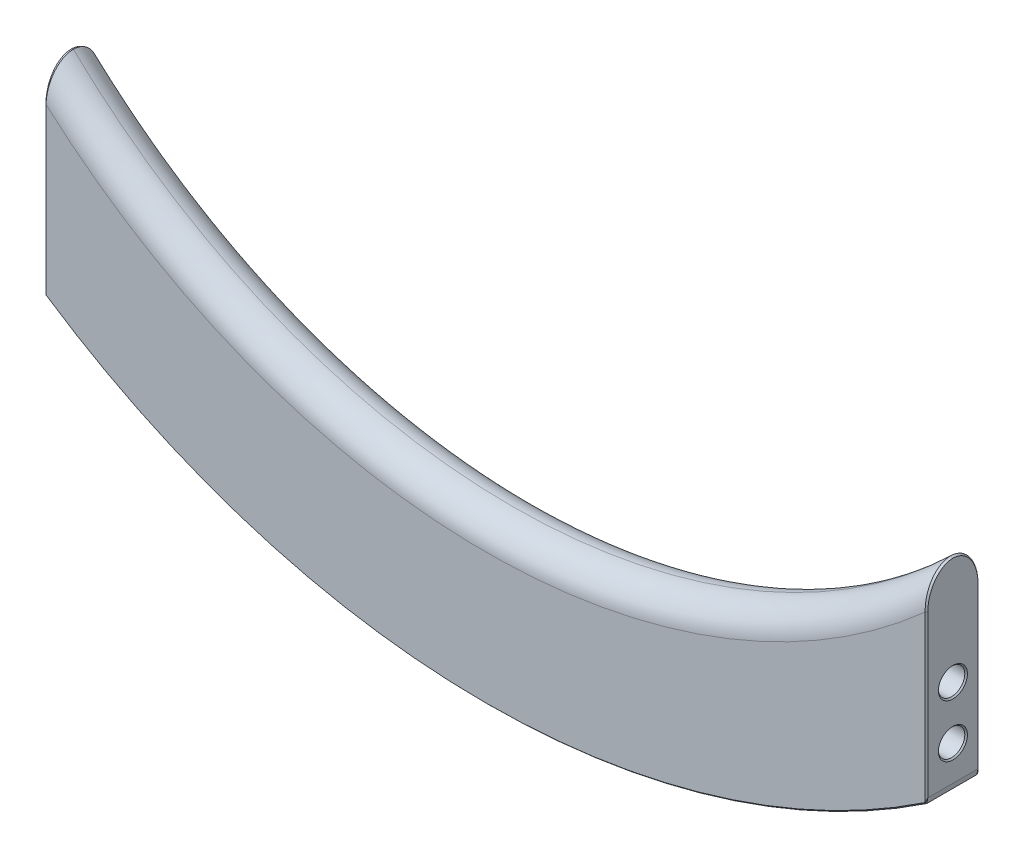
ISO-10303-21;
HEADER;
FILE_DESCRIPTION(('STEP AP214'),'2;1');
FILE_NAME('part.step','',(''),(''),'','','');
FILE_SCHEMA(('AUTOMOTIVE_DESIGN { 1 0 10303 214 1 1 1 1 }'));
ENDSEC;
DATA;
#1=APPLICATION_CONTEXT('core data for automotive mechanical design processes');
#2=APPLICATION_PROTOCOL_DEFINITION('international standard','automotive_design',2000,#1);
#3=PRODUCT_CONTEXT('',#1,'mechanical');
#4=PRODUCT('Part','Part','',(#3));
#5=PRODUCT_RELATED_PRODUCT_CATEGORY('part','',(#4));
#6=PRODUCT_DEFINITION_FORMATION('','',#4);
#7=PRODUCT_DEFINITION_CONTEXT('part definition',#1,'design');
#8=PRODUCT_DEFINITION('design','',#6,#7);
#9=PRODUCT_DEFINITION_SHAPE('','',#8);
#10=(LENGTH_UNIT() NAMED_UNIT(*) SI_UNIT(.MILLI.,.METRE.));
#11=(NAMED_UNIT(*) PLANE_ANGLE_UNIT() SI_UNIT($,.RADIAN.));
#12=(NAMED_UNIT(*) SI_UNIT($,.STERADIAN.) SOLID_ANGLE_UNIT());
#13=UNCERTAINTY_MEASURE_WITH_UNIT(LENGTH_MEASURE(1.E-05),#10,'distance_accuracy_value','');
#14=(GEOMETRIC_REPRESENTATION_CONTEXT(3) GLOBAL_UNCERTAINTY_ASSIGNED_CONTEXT((#13)) GLOBAL_UNIT_ASSIGNED_CONTEXT((#10,
#11,#12)) REPRESENTATION_CONTEXT('',''));
#15=CARTESIAN_POINT('',(0.,0.,0.));
#16=DIRECTION('',(0.,0.,1.));
#17=DIRECTION('',(1.,0.,0.));
#18=AXIS2_PLACEMENT_3D('',#15,#16,#17);
#19=CARTESIAN_POINT('',(-167.,-172.368790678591,10.));
#20=DIRECTION('',(1.,0.,0.));
#21=DIRECTION('',(0.,1.,0.));
#22=AXIS2_PLACEMENT_3D('',#19,#20,#21);
#23=PLANE('',#22);
#24=CARTESIAN_POINT('',(-167.,-234.220785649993,0.));
#25=DIRECTION('',(1.,0.,0.));
#26=DIRECTION('',(0.,1.,0.));
#27=AXIS2_PLACEMENT_3D('',#24,#25,#26);
#28=CIRCLE('',#27,5.50000000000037);
#29=CARTESIAN_POINT('',(-167.,-228.720785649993,0.));
#30=VERTEX_POINT('',#29);
#31=EDGE_CURVE('E160',#30,#30,#28,.T.);
#32=ORIENTED_EDGE('',*,*,#31,.T.);
#33=EDGE_LOOP('',(#32));
#34=FACE_BOUND('',#33,.T.);
#35=CARTESIAN_POINT('',(-167.,-214.220785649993,0.));
#36=DIRECTION('',(1.,0.,0.));
#37=DIRECTION('',(0.,1.,0.));
#38=AXIS2_PLACEMENT_3D('',#35,#36,#37);
#39=CIRCLE('',#38,5.50000000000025);
#40=CARTESIAN_POINT('',(-167.,-208.720785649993,0.));
#41=VERTEX_POINT('',#40);
#42=EDGE_CURVE('E157',#41,#41,#39,.T.);
#43=ORIENTED_EDGE('',*,*,#42,.T.);
#44=EDGE_LOOP('',(#43));
#45=FACE_BOUND('',#44,.T.);
#46=DIRECTION('',(0.,-1.,0.));
#47=VECTOR('',#46,1.);
#48=CARTESIAN_POINT('',(-167.,-172.368790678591,-9.5));
#49=LINE('',#48,#47);
#50=CARTESIAN_POINT('',(-167.,-186.487935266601,-9.5));
#51=VERTEX_POINT('',#50);
#52=CARTESIAN_POINT('',(-167.,-248.720785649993,-9.5));
#53=VERTEX_POINT('',#52);
#54=EDGE_CURVE('E156',#51,#53,#49,.T.);
#55=ORIENTED_EDGE('',*,*,#54,.T.);
#56=DIRECTION('',(0.,0.,1.));
#57=VECTOR('',#56,1.);
#58=CARTESIAN_POINT('',(-167.,-248.720785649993,10.));
#59=LINE('',#58,#57);
#60=CARTESIAN_POINT('',(-167.,-248.720785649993,9.5));
#61=VERTEX_POINT('',#60);
#62=EDGE_CURVE('E139',#53,#61,#59,.T.);
#63=ORIENTED_EDGE('',*,*,#62,.T.);
#64=DIRECTION('',(0.,1.,0.));
#65=VECTOR('',#64,1.);
#66=CARTESIAN_POINT('',(-167.,-186.040318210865,9.5));
#67=LINE('',#66,#65);
#68=CARTESIAN_POINT('',(-167.,-186.487935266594,9.5));
#69=VERTEX_POINT('',#68);
#70=EDGE_CURVE('E145',#61,#69,#67,.T.);
#71=ORIENTED_EDGE('',*,*,#70,.T.);
#72=CARTESIAN_POINT('',(-167.,-173.545383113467,0.));
#73=CARTESIAN_POINT('',(-167.,-173.538921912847,1.48173565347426));
#74=CARTESIAN_POINT('',(-167.,-174.041638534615,2.93362200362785));
#75=CARTESIAN_POINT('',(-167.,-175.707416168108,5.3930119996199));
#76=CARTESIAN_POINT('',(-167.,-176.817437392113,6.39422092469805));
#77=CARTESIAN_POINT('',(-167.,-179.326803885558,7.97856826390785));
#78=CARTESIAN_POINT('',(-167.,-180.677158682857,8.54210713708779));
#79=CARTESIAN_POINT('',(-167.,-183.540260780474,9.31186177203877));
#80=CARTESIAN_POINT('',(-167.,-185.005194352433,9.49883322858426));
#81=CARTESIAN_POINT('',(-167.,-186.487935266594,9.5));
#82=B_SPLINE_CURVE_WITH_KNOTS('',3,(#72,#73,#74,#75,#76,#77,#78,#79,#80,#81),.UNSPECIFIED.,.F.,
.F.,(4,2,2,2,4),(0.,0.00440937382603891,0.00881874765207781,0.0132281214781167,
0.0176374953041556),.UNSPECIFIED.);
#83=CARTESIAN_POINT('',(-167.,-173.545383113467,0.));
#84=VERTEX_POINT('',#83);
#85=EDGE_CURVE('E152',#69,#84,#82,.F.);
#86=ORIENTED_EDGE('',*,*,#85,.T.);
#87=CARTESIAN_POINT('',(-167.,-186.487935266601,-9.5));
#88=CARTESIAN_POINT('',(-167.,-183.549003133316,-9.49638799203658));
#89=CARTESIAN_POINT('',(-167.,-180.574808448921,-8.75073644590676));
#90=CARTESIAN_POINT('',(-167.,-176.830144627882,-6.41013612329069));
#91=CARTESIAN_POINT('',(-167.,-175.708705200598,-5.39309467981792));
#92=CARTESIAN_POINT('',(-167.,-174.045147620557,-2.94066287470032));
#93=CARTESIAN_POINT('',(-167.,-173.539374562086,-1.48661162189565));
#94=CARTESIAN_POINT('',(-167.,-173.545383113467,0.));
#95=B_SPLINE_CURVE_WITH_KNOTS('',3,(#87,#88,#89,#90,#91,#92,#93,#94),.UNSPECIFIED.,.F.,.F.,(4,2,
2,4),(0.,0.00881054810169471,0.0132158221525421,0.0176210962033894),.UNSPECIFIED.);
#96=EDGE_CURVE('E162',#84,#51,#95,.F.);
#97=ORIENTED_EDGE('',*,*,#96,.T.);
#98=EDGE_LOOP('',(#55,#63,#71,#86,#97));
#99=FACE_BOUND('',#98,.T.);
#100=ADVANCED_FACE('F31',(#34,#45,#99),#23,.F.);
#101=CARTESIAN_POINT('',(0.,0.,10.));
#102=DIRECTION('',(0.,0.,-1.));
#103=DIRECTION('',(-1.,0.,0.));
#104=AXIS2_PLACEMENT_3D('',#101,#102,#103);
#105=CYLINDRICAL_SURFACE('',#104,300.);
#106=DIRECTION('',(0.,0.,-1.));
#107=VECTOR('',#106,1.);
#108=CARTESIAN_POINT('',(-165.504081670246,-250.216703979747,10.));
#109=LINE('',#108,#107);
#110=CARTESIAN_POINT('',(-165.504081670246,-250.216703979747,9.5));
#111=VERTEX_POINT('',#110);
#112=CARTESIAN_POINT('',(-165.504081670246,-250.216703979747,-9.5));
#113=VERTEX_POINT('',#112);
#114=EDGE_CURVE('E141',#111,#113,#109,.T.);
#115=ORIENTED_EDGE('',*,*,#114,.T.);
#116=CARTESIAN_POINT('',(0.,0.,-9.5));
#117=DIRECTION('',(0.,0.,1.));
#118=DIRECTION('',(1.,0.,0.));
#119=AXIS2_PLACEMENT_3D('',#116,#117,#118);
#120=CIRCLE('',#119,300.);
#121=CARTESIAN_POINT('',(166.584746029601,-249.498541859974,-9.5));
#122=VERTEX_POINT('',#121);
#123=EDGE_CURVE('E263',#113,#122,#120,.T.);
#124=ORIENTED_EDGE('',*,*,#123,.T.);
#125=DIRECTION('',(0.,0.,-1.));
#126=VECTOR('',#125,1.);
#127=CARTESIAN_POINT('',(166.584746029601,-249.498541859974,10.));
#128=LINE('',#127,#126);
#129=CARTESIAN_POINT('',(166.584746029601,-249.498541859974,9.5));
#130=VERTEX_POINT('',#129);
#131=EDGE_CURVE('E260',#122,#130,#128,.F.);
#132=ORIENTED_EDGE('',*,*,#131,.T.);
#133=CARTESIAN_POINT('',(0.,0.,9.5));
#134=DIRECTION('',(0.,0.,1.));
#135=DIRECTION('',(1.,0.,0.));
#136=AXIS2_PLACEMENT_3D('',#133,#134,#135);
#137=CIRCLE('',#136,300.);
#138=EDGE_CURVE('E257',#130,#111,#137,.F.);
#139=ORIENTED_EDGE('',*,*,#138,.T.);
#140=EDGE_LOOP('',(#115,#124,#132,#139));
#141=FACE_BOUND('',#140,.T.);
#142=ADVANCED_FACE('F215',(#141),#105,.T.);
#143=CARTESIAN_POINT('',(167.,-172.368790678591,10.));
#144=DIRECTION('',(-1.,0.,0.));
#145=DIRECTION('',(0.,-1.,0.));
#146=AXIS2_PLACEMENT_3D('',#143,#144,#145);
#147=PLANE('',#146);
#148=CARTESIAN_POINT('',(167.,-234.220785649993,0.));
#149=DIRECTION('',(-1.,0.,0.));
#150=DIRECTION('',(0.,-1.,0.));
#151=AXIS2_PLACEMENT_3D('',#148,#149,#150);
#152=CIRCLE('',#151,5.50000000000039);
#153=CARTESIAN_POINT('',(167.,-239.720785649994,0.));
#154=VERTEX_POINT('',#153);
#155=EDGE_CURVE('E242',#154,#154,#152,.T.);
#156=ORIENTED_EDGE('',*,*,#155,.T.);
#157=EDGE_LOOP('',(#156));
#158=FACE_BOUND('',#157,.T.);
#159=CARTESIAN_POINT('',(167.,-214.220785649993,0.));
#160=DIRECTION('',(-1.,0.,0.));
#161=DIRECTION('',(0.,-1.,0.));
#162=AXIS2_PLACEMENT_3D('',#159,#160,#161);
#163=CIRCLE('',#162,5.50000000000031);
#164=CARTESIAN_POINT('',(167.,-219.720785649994,0.));
#165=VERTEX_POINT('',#164);
#166=EDGE_CURVE('E239',#165,#165,#163,.T.);
#167=ORIENTED_EDGE('',*,*,#166,.T.);
#168=EDGE_LOOP('',(#167));
#169=FACE_BOUND('',#168,.T.);
#170=DIRECTION('',(0.,-1.,0.));
#171=VECTOR('',#170,1.);
#172=CARTESIAN_POINT('',(167.,-249.220785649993,9.5));
#173=LINE('',#172,#171);
#174=CARTESIAN_POINT('',(167.,-186.487935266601,9.5));
#175=VERTEX_POINT('',#174);
#176=CARTESIAN_POINT('',(167.,-247.396429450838,9.5));
#177=VERTEX_POINT('',#176);
#178=EDGE_CURVE('E193',#175,#177,#173,.T.);
#179=ORIENTED_EDGE('',*,*,#178,.T.);
#180=DIRECTION('',(0.,0.,-1.));
#181=VECTOR('',#180,1.);
#182=CARTESIAN_POINT('',(167.,-247.396429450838,10.));
#183=LINE('',#182,#181);
#184=CARTESIAN_POINT('',(167.,-247.396429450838,-9.5));
#185=VERTEX_POINT('',#184);
#186=EDGE_CURVE('E233',#177,#185,#183,.T.);
#187=ORIENTED_EDGE('',*,*,#186,.T.);
#188=DIRECTION('',(0.,1.,0.));
#189=VECTOR('',#188,1.);
#190=CARTESIAN_POINT('',(167.,-172.368790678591,-9.5));
#191=LINE('',#190,#189);
#192=CARTESIAN_POINT('',(167.,-186.487935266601,-9.5));
#193=VERTEX_POINT('',#192);
#194=EDGE_CURVE('E226',#185,#193,#191,.T.);
#195=ORIENTED_EDGE('',*,*,#194,.T.);
#196=CARTESIAN_POINT('',(167.,-173.545383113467,0.));
#197=CARTESIAN_POINT('',(167.,-173.538921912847,-1.48173565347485));
#198=CARTESIAN_POINT('',(167.,-174.041638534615,-2.93362200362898));
#199=CARTESIAN_POINT('',(167.,-175.70741616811,-5.39301199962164));
#200=CARTESIAN_POINT('',(167.,-176.817437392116,-6.39422092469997));
#201=CARTESIAN_POINT('',(167.,-179.326803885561,-7.97856826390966));
#202=CARTESIAN_POINT('',(167.,-180.677158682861,-8.54210713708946));
#203=CARTESIAN_POINT('',(167.,-183.54026078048,-9.31186177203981));
#204=CARTESIAN_POINT('',(167.,-185.005194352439,-9.49883322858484));
#205=CARTESIAN_POINT('',(167.,-186.487935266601,-9.5));
#206=B_SPLINE_CURVE_WITH_KNOTS('',3,(#196,#197,#198,#199,#200,#201,#202,#203,#204,#205),
.UNSPECIFIED.,.F.,.F.,(4,2,2,2,4),(0.,0.00440937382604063,0.00881874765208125,
0.0132281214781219,0.0176374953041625),.UNSPECIFIED.);
#207=CARTESIAN_POINT('',(167.,-173.545383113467,0.));
#208=VERTEX_POINT('',#207);
#209=EDGE_CURVE('E234',#193,#208,#206,.F.);
#210=ORIENTED_EDGE('',*,*,#209,.T.);
#211=CARTESIAN_POINT('',(167.,-186.487935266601,9.5));
#212=CARTESIAN_POINT('',(167.,-183.549003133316,9.49638799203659));
#213=CARTESIAN_POINT('',(167.,-180.574808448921,8.75073644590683));
#214=CARTESIAN_POINT('',(167.,-176.830144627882,6.41013612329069));
#215=CARTESIAN_POINT('',(167.,-175.708705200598,5.39309467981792));
#216=CARTESIAN_POINT('',(167.,-174.045147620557,2.94066287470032));
#217=CARTESIAN_POINT('',(167.,-173.539374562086,1.48661162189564));
#218=CARTESIAN_POINT('',(167.,-173.545383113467,0.));
#219=B_SPLINE_CURVE_WITH_KNOTS('',3,(#211,#212,#213,#214,#215,#216,#217,#218),.UNSPECIFIED.,.F.,
.F.,(4,2,2,4),(0.,0.00881054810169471,0.0132158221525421,0.0176210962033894),.UNSPECIFIED.);
#220=EDGE_CURVE('E197',#208,#175,#219,.F.);
#221=ORIENTED_EDGE('',*,*,#220,.T.);
#222=EDGE_LOOP('',(#179,#187,#195,#210,#221));
#223=FACE_BOUND('',#222,.T.);
#224=ADVANCED_FACE('F204',(#158,#169,#223),#147,.F.);
#225=CARTESIAN_POINT('',(0.,0.,10.));
#226=DIRECTION('',(0.,0.,1.));
#227=DIRECTION('',(1.,0.,0.));
#228=AXIS2_PLACEMENT_3D('',#225,#226,#227);
#229=PLANE('',#228);
#230=CARTESIAN_POINT('',(0.,0.,10.));
#231=DIRECTION('',(0.,0.,1.));
#232=DIRECTION('',(1.,0.,0.));
#233=AXIS2_PLACEMENT_3D('',#230,#231,#232);
#234=CIRCLE('',#233,250.);
#235=CARTESIAN_POINT('',(166.5,-186.487935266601,10.));
#236=VERTEX_POINT('',#235);
#237=CARTESIAN_POINT('',(-166.504223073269,-186.484164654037,10.));
#238=VERTEX_POINT('',#237);
#239=EDGE_CURVE('E153',#236,#238,#234,.F.);
#240=ORIENTED_EDGE('',*,*,#239,.T.);
#241=DIRECTION('',(0.,-1.,0.));
#242=VECTOR('',#241,1.);
#243=CARTESIAN_POINT('',(-166.5,-249.220785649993,10.));
#244=LINE('',#243,#242);
#245=CARTESIAN_POINT('',(-166.5,-248.953810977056,10.));
#246=VERTEX_POINT('',#245);
#247=EDGE_CURVE('E11',#238,#246,#244,.T.);
#248=ORIENTED_EDGE('',*,*,#247,.T.);
#249=CARTESIAN_POINT('',(0.,0.,10.));
#250=DIRECTION('',(0.,0.,1.));
#251=DIRECTION('',(1.,0.,0.));
#252=AXIS2_PLACEMENT_3D('',#249,#250,#251);
#253=CIRCLE('',#252,299.5);
#254=CARTESIAN_POINT('',(166.5,-248.953810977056,10.));
#255=VERTEX_POINT('',#254);
#256=EDGE_CURVE('E44',#246,#255,#253,.T.);
#257=ORIENTED_EDGE('',*,*,#256,.T.);
#258=DIRECTION('',(0.,1.,0.));
#259=VECTOR('',#258,1.);
#260=CARTESIAN_POINT('',(166.5,-186.040318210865,10.));
#261=LINE('',#260,#259);
#262=EDGE_CURVE('E314',#255,#236,#261,.T.);
#263=ORIENTED_EDGE('',*,*,#262,.T.);
#264=EDGE_LOOP('',(#240,#248,#257,#263));
#265=FACE_BOUND('',#264,.T.);
#266=ADVANCED_FACE('F214',(#265),#229,.T.);
#267=CARTESIAN_POINT('',(0.,0.,-10.));
#268=DIRECTION('',(0.,0.,1.));
#269=DIRECTION('',(1.,0.,0.));
#270=AXIS2_PLACEMENT_3D('',#267,#268,#269);
#271=PLANE('',#270);
#272=CARTESIAN_POINT('',(0.,0.,-10.));
#273=DIRECTION('',(0.,0.,1.));
#274=DIRECTION('',(1.,0.,0.));
#275=AXIS2_PLACEMENT_3D('',#272,#273,#274);
#276=CIRCLE('',#275,299.5);
#277=CARTESIAN_POINT('',(166.5,-248.953810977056,-10.));
#278=VERTEX_POINT('',#277);
#279=CARTESIAN_POINT('',(-166.5,-248.953810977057,-10.));
#280=VERTEX_POINT('',#279);
#281=EDGE_CURVE('E604',#278,#280,#276,.F.);
#282=ORIENTED_EDGE('',*,*,#281,.T.);
#283=DIRECTION('',(0.,1.,0.));
#284=VECTOR('',#283,1.);
#285=CARTESIAN_POINT('',(-166.5,0.,-10.));
#286=LINE('',#285,#284);
#287=CARTESIAN_POINT('',(-166.5,-186.487935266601,-10.));
#288=VERTEX_POINT('',#287);
#289=EDGE_CURVE('E588',#280,#288,#286,.T.);
#290=ORIENTED_EDGE('',*,*,#289,.T.);
#291=CARTESIAN_POINT('',(0.,0.,-10.));
#292=DIRECTION('',(0.,0.,1.));
#293=DIRECTION('',(1.,0.,0.));
#294=AXIS2_PLACEMENT_3D('',#291,#292,#293);
#295=CIRCLE('',#294,250.);
#296=CARTESIAN_POINT('',(166.504223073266,-186.484164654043,-10.));
#297=VERTEX_POINT('',#296);
#298=EDGE_CURVE('E266',#288,#297,#295,.T.);
#299=ORIENTED_EDGE('',*,*,#298,.T.);
#300=DIRECTION('',(0.,-1.,0.));
#301=VECTOR('',#300,1.);
#302=CARTESIAN_POINT('',(166.5,0.,-10.));
#303=LINE('',#302,#301);
#304=EDGE_CURVE('E265',#297,#278,#303,.T.);
#305=ORIENTED_EDGE('',*,*,#304,.T.);
#306=EDGE_LOOP('',(#282,#290,#299,#305));
#307=FACE_BOUND('',#306,.T.);
#308=ADVANCED_FACE('F306',(#307),#271,.F.);
#309=CARTESIAN_POINT('',(0.,0.,0.));
#310=DIRECTION('',(0.,0.,1.));
#311=DIRECTION('',(1.,0.,0.));
#312=AXIS2_PLACEMENT_3D('',#309,#310,#311);
#313=TOROIDAL_SURFACE('',#312,250.,10.);
#314=CARTESIAN_POINT('',(0.,0.,0.));
#315=DIRECTION('',(0.,0.,1.));
#316=DIRECTION('',(1.,0.,0.));
#317=AXIS2_PLACEMENT_3D('',#314,#315,#316);
#318=CIRCLE('',#317,240.);
#319=CARTESIAN_POINT('',(-166.149573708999,-173.188680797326,0.));
#320=VERTEX_POINT('',#319);
#321=CARTESIAN_POINT('',(166.149573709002,-173.188680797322,0.));
#322=VERTEX_POINT('',#321);
#323=EDGE_CURVE('E270',#320,#322,#318,.T.);
#324=ORIENTED_EDGE('',*,*,#323,.F.);
#325=CARTESIAN_POINT('',(-166.5,-186.487935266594,10.));
#326=CARTESIAN_POINT('',(-166.461230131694,-184.961769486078,9.99877181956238));
#327=CARTESIAN_POINT('',(-166.422613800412,-183.454628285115,9.80195976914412));
#328=CARTESIAN_POINT('',(-166.346582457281,-180.510350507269,8.99169171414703));
#329=CARTESIAN_POINT('',(-166.310437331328,-179.122385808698,8.39849292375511));
#330=CARTESIAN_POINT('',(-166.242872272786,-176.544119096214,6.73075885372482));
#331=CARTESIAN_POINT('',(-166.212763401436,-175.40417528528,5.6768547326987));
#332=CARTESIAN_POINT('',(-166.167427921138,-173.693895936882,3.0880231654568));
#333=CARTESIAN_POINT('',(-166.153665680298,-173.177960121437,1.55972174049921));
#334=CARTESIAN_POINT('',(-166.153846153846,-173.184581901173,0.));
#335=B_SPLINE_CURVE_WITH_KNOTS('',3,(#325,#326,#327,#328,#329,#330,#331,#332,#333,#334),
.UNSPECIFIED.,.F.,.F.,(4,2,2,2,4),(0.,0.00440937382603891,0.00881874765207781,
0.0132281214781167,0.0176374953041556),.UNSPECIFIED.);
#336=EDGE_CURVE('E321',#320,#238,#335,.F.);
#337=ORIENTED_EDGE('',*,*,#336,.T.);
#338=ORIENTED_EDGE('',*,*,#239,.F.);
#339=CARTESIAN_POINT('',(166.153846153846,-173.184581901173,0.));
#340=CARTESIAN_POINT('',(166.153678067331,-173.178424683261,1.56485433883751));
#341=CARTESIAN_POINT('',(166.167523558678,-173.697498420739,3.09543462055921));
#342=CARTESIAN_POINT('',(166.212798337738,-175.405499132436,5.67694175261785));
#343=CARTESIAN_POINT('',(166.243213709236,-176.557174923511,6.74751146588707));
#344=CARTESIAN_POINT('',(166.34404145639,-180.404657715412,9.21130200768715));
#345=CARTESIAN_POINT('',(166.423183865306,-183.462859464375,9.99619788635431));
#346=CARTESIAN_POINT('',(166.5,-186.487935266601,10.));
#347=B_SPLINE_CURVE_WITH_KNOTS('',3,(#339,#340,#341,#342,#343,#344,#345,#346),.UNSPECIFIED.,.F.,
.F.,(4,2,2,4),(0.,0.00440527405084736,0.00881054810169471,0.0176210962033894),.UNSPECIFIED.);
#348=EDGE_CURVE('E289',#236,#322,#347,.F.);
#349=ORIENTED_EDGE('',*,*,#348,.T.);
#350=EDGE_LOOP('',(#324,#337,#338,#349));
#351=FACE_BOUND('',#350,.T.);
#352=ADVANCED_FACE('F296',(#351),#313,.T.);
#353=CARTESIAN_POINT('',(0.,0.,0.));
#354=DIRECTION('',(0.,0.,1.));
#355=DIRECTION('',(1.,0.,0.));
#356=AXIS2_PLACEMENT_3D('',#353,#354,#355);
#357=TOROIDAL_SURFACE('',#356,250.,10.);
#358=ORIENTED_EDGE('',*,*,#298,.F.);
#359=CARTESIAN_POINT('',(-166.153846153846,-173.184581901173,0.));
#360=CARTESIAN_POINT('',(-166.153678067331,-173.178424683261,-1.56485433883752));
#361=CARTESIAN_POINT('',(-166.167523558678,-173.697498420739,-3.09543462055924));
#362=CARTESIAN_POINT('',(-166.212798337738,-175.405499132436,-5.67694175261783));
#363=CARTESIAN_POINT('',(-166.243213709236,-176.557174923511,-6.74751146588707));
#364=CARTESIAN_POINT('',(-166.34404145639,-180.404657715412,-9.21130200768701));
#365=CARTESIAN_POINT('',(-166.423183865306,-183.462859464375,-9.99619788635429));
#366=CARTESIAN_POINT('',(-166.5,-186.487935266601,-10.));
#367=B_SPLINE_CURVE_WITH_KNOTS('',3,(#359,#360,#361,#362,#363,#364,#365,#366),.UNSPECIFIED.,.F.,
.F.,(4,2,2,4),(0.,0.00440527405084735,0.00881054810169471,0.0176210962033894),.UNSPECIFIED.);
#368=EDGE_CURVE('E565',#288,#320,#367,.F.);
#369=ORIENTED_EDGE('',*,*,#368,.T.);
#370=ORIENTED_EDGE('',*,*,#323,.T.);
#371=CARTESIAN_POINT('',(166.5,-186.487935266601,-10.));
#372=CARTESIAN_POINT('',(166.461230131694,-184.961769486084,-9.99877181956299));
#373=CARTESIAN_POINT('',(166.422613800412,-183.454628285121,-9.8019597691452));
#374=CARTESIAN_POINT('',(166.346582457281,-180.510350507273,-8.99169171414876));
#375=CARTESIAN_POINT('',(166.310437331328,-179.122385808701,-8.39849292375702));
#376=CARTESIAN_POINT('',(166.242872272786,-176.544119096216,-6.73075885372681));
#377=CARTESIAN_POINT('',(166.212763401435,-175.404175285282,-5.67685473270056));
#378=CARTESIAN_POINT('',(166.167427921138,-173.693895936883,-3.08802316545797));
#379=CARTESIAN_POINT('',(166.153665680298,-173.177960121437,-1.55972174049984));
#380=CARTESIAN_POINT('',(166.153846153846,-173.184581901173,0.));
#381=B_SPLINE_CURVE_WITH_KNOTS('',3,(#371,#372,#373,#374,#375,#376,#377,#378,#379,#380),
.UNSPECIFIED.,.F.,.F.,(4,2,2,2,4),(0.,0.00440937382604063,0.00881874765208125,
0.0132281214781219,0.0176374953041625),.UNSPECIFIED.);
#382=EDGE_CURVE('E606',#322,#297,#381,.F.);
#383=ORIENTED_EDGE('',*,*,#382,.T.);
#384=EDGE_LOOP('',(#358,#369,#370,#383));
#385=FACE_BOUND('',#384,.T.);
#386=ADVANCED_FACE('F305',(#385),#357,.T.);
#387=CARTESIAN_POINT('',(142.,-214.220785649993,0.));
#388=DIRECTION('',(1.,0.,0.));
#389=DIRECTION('',(0.,1.,0.));
#390=AXIS2_PLACEMENT_3D('',#387,#388,#389);
#391=CYLINDRICAL_SURFACE('',#390,5.);
#392=CARTESIAN_POINT('',(166.5,-214.220785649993,0.));
#393=DIRECTION('',(-1.,0.,0.));
#394=DIRECTION('',(0.,0.,1.));
#395=AXIS2_PLACEMENT_3D('',#392,#393,#394);
#396=CIRCLE('',#395,5.);
#397=CARTESIAN_POINT('',(166.5,-214.220785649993,5.));
#398=VERTEX_POINT('',#397);
#399=EDGE_CURVE('E251',#398,#398,#396,.F.);
#400=ORIENTED_EDGE('',*,*,#399,.T.);
#401=EDGE_LOOP('',(#400));
#402=FACE_BOUND('',#401,.T.);
#403=CARTESIAN_POINT('',(142.5,-214.220785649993,0.));
#404=DIRECTION('',(1.,0.,0.));
#405=DIRECTION('',(0.,0.,-1.));
#406=AXIS2_PLACEMENT_3D('',#403,#404,#405);
#407=CIRCLE('',#406,5.);
#408=CARTESIAN_POINT('',(142.5,-214.220785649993,-5.));
#409=VERTEX_POINT('',#408);
#410=EDGE_CURVE('E248',#409,#409,#407,.F.);
#411=ORIENTED_EDGE('',*,*,#410,.T.);
#412=EDGE_LOOP('',(#411));
#413=FACE_BOUND('',#412,.T.);
#414=ADVANCED_FACE('F856',(#402,#413),#391,.F.);
#415=CARTESIAN_POINT('',(142.,-214.220785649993,0.));
#416=DIRECTION('',(1.,0.,0.));
#417=DIRECTION('',(0.,1.,0.));
#418=AXIS2_PLACEMENT_3D('',#415,#416,#417);
#419=PLANE('',#418);
#420=CARTESIAN_POINT('',(142.,-214.220785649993,0.));
#421=DIRECTION('',(1.,0.,0.));
#422=DIRECTION('',(0.,1.,0.));
#423=AXIS2_PLACEMENT_3D('',#420,#421,#422);
#424=CIRCLE('',#423,4.50000000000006);
#425=CARTESIAN_POINT('',(142.,-209.720785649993,0.));
#426=VERTEX_POINT('',#425);
#427=EDGE_CURVE('E254',#426,#426,#424,.T.);
#428=ORIENTED_EDGE('',*,*,#427,.T.);
#429=EDGE_LOOP('',(#428));
#430=FACE_BOUND('',#429,.T.);
#431=ADVANCED_FACE('F846',(#430),#419,.T.);
#432=CARTESIAN_POINT('',(142.,-234.220785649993,0.));
#433=DIRECTION('',(1.,0.,0.));
#434=DIRECTION('',(0.,1.,0.));
#435=AXIS2_PLACEMENT_3D('',#432,#433,#434);
#436=CYLINDRICAL_SURFACE('',#435,5.);
#437=CARTESIAN_POINT('',(166.5,-234.220785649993,0.));
#438=DIRECTION('',(-1.,0.,0.));
#439=DIRECTION('',(0.,0.,1.));
#440=AXIS2_PLACEMENT_3D('',#437,#438,#439);
#441=CIRCLE('',#440,5.);
#442=CARTESIAN_POINT('',(166.5,-234.220785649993,5.));
#443=VERTEX_POINT('',#442);
#444=EDGE_CURVE('E190',#443,#443,#441,.F.);
#445=ORIENTED_EDGE('',*,*,#444,.T.);
#446=EDGE_LOOP('',(#445));
#447=FACE_BOUND('',#446,.T.);
#448=CARTESIAN_POINT('',(142.5,-234.220785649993,0.));
#449=DIRECTION('',(1.,0.,0.));
#450=DIRECTION('',(0.,0.,-1.));
#451=AXIS2_PLACEMENT_3D('',#448,#449,#450);
#452=CIRCLE('',#451,5.);
#453=CARTESIAN_POINT('',(142.5,-234.220785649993,-5.));
#454=VERTEX_POINT('',#453);
#455=EDGE_CURVE('E187',#454,#454,#452,.F.);
#456=ORIENTED_EDGE('',*,*,#455,.T.);
#457=EDGE_LOOP('',(#456));
#458=FACE_BOUND('',#457,.T.);
#459=ADVANCED_FACE('F836',(#447,#458),#436,.F.);
#460=CARTESIAN_POINT('',(142.,-234.220785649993,0.));
#461=DIRECTION('',(1.,0.,0.));
#462=DIRECTION('',(0.,1.,0.));
#463=AXIS2_PLACEMENT_3D('',#460,#461,#462);
#464=PLANE('',#463);
#465=CARTESIAN_POINT('',(142.,-234.220785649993,0.));
#466=DIRECTION('',(1.,0.,0.));
#467=DIRECTION('',(0.,1.,0.));
#468=AXIS2_PLACEMENT_3D('',#465,#466,#467);
#469=CIRCLE('',#468,4.50000000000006);
#470=CARTESIAN_POINT('',(142.,-229.720785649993,0.));
#471=VERTEX_POINT('',#470);
#472=EDGE_CURVE('E245',#471,#471,#469,.T.);
#473=ORIENTED_EDGE('',*,*,#472,.T.);
#474=EDGE_LOOP('',(#473));
#475=FACE_BOUND('',#474,.T.);
#476=ADVANCED_FACE('F825',(#475),#464,.T.);
#477=CARTESIAN_POINT('',(-142.,-214.220785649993,0.));
#478=DIRECTION('',(-1.,0.,0.));
#479=DIRECTION('',(0.,-1.,0.));
#480=AXIS2_PLACEMENT_3D('',#477,#478,#479);
#481=CYLINDRICAL_SURFACE('',#480,5.);
#482=CARTESIAN_POINT('',(-166.5,-214.220785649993,0.));
#483=DIRECTION('',(1.,0.,0.));
#484=DIRECTION('',(0.,0.,-1.));
#485=AXIS2_PLACEMENT_3D('',#482,#483,#484);
#486=CIRCLE('',#485,5.);
#487=CARTESIAN_POINT('',(-166.5,-214.220785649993,-5.));
#488=VERTEX_POINT('',#487);
#489=EDGE_CURVE('E181',#488,#488,#486,.F.);
#490=ORIENTED_EDGE('',*,*,#489,.T.);
#491=EDGE_LOOP('',(#490));
#492=FACE_BOUND('',#491,.T.);
#493=CARTESIAN_POINT('',(-142.5,-214.220785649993,0.));
#494=DIRECTION('',(-1.,0.,0.));
#495=DIRECTION('',(0.,0.,1.));
#496=AXIS2_PLACEMENT_3D('',#493,#494,#495);
#497=CIRCLE('',#496,5.);
#498=CARTESIAN_POINT('',(-142.5,-214.220785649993,5.));
#499=VERTEX_POINT('',#498);
#500=EDGE_CURVE('E178',#499,#499,#497,.F.);
#501=ORIENTED_EDGE('',*,*,#500,.T.);
#502=EDGE_LOOP('',(#501));
#503=FACE_BOUND('',#502,.T.);
#504=ADVANCED_FACE('F815',(#492,#503),#481,.F.);
#505=CARTESIAN_POINT('',(-142.,-214.220785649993,0.));
#506=DIRECTION('',(-1.,0.,0.));
#507=DIRECTION('',(0.,1.,0.));
#508=AXIS2_PLACEMENT_3D('',#505,#506,#507);
#509=PLANE('',#508);
#510=CARTESIAN_POINT('',(-142.,-214.220785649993,0.));
#511=DIRECTION('',(-1.,0.,0.));
#512=DIRECTION('',(0.,-1.,0.));
#513=AXIS2_PLACEMENT_3D('',#510,#511,#512);
#514=CIRCLE('',#513,4.5);
#515=CARTESIAN_POINT('',(-142.,-218.720785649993,0.));
#516=VERTEX_POINT('',#515);
#517=EDGE_CURVE('E184',#516,#516,#514,.T.);
#518=ORIENTED_EDGE('',*,*,#517,.T.);
#519=EDGE_LOOP('',(#518));
#520=FACE_BOUND('',#519,.T.);
#521=ADVANCED_FACE('F805',(#520),#509,.T.);
#522=CARTESIAN_POINT('',(-142.,-234.220785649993,0.));
#523=DIRECTION('',(-1.,0.,0.));
#524=DIRECTION('',(0.,-1.,0.));
#525=AXIS2_PLACEMENT_3D('',#522,#523,#524);
#526=CYLINDRICAL_SURFACE('',#525,5.);
#527=CARTESIAN_POINT('',(-166.5,-234.220785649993,0.));
#528=DIRECTION('',(1.,0.,0.));
#529=DIRECTION('',(0.,0.,-1.));
#530=AXIS2_PLACEMENT_3D('',#527,#528,#529);
#531=CIRCLE('',#530,5.);
#532=CARTESIAN_POINT('',(-166.5,-234.220785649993,-5.));
#533=VERTEX_POINT('',#532);
#534=EDGE_CURVE('E172',#533,#533,#531,.F.);
#535=ORIENTED_EDGE('',*,*,#534,.T.);
#536=EDGE_LOOP('',(#535));
#537=FACE_BOUND('',#536,.T.);
#538=CARTESIAN_POINT('',(-142.5,-234.220785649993,0.));
#539=DIRECTION('',(-1.,0.,0.));
#540=DIRECTION('',(0.,0.,1.));
#541=AXIS2_PLACEMENT_3D('',#538,#539,#540);
#542=CIRCLE('',#541,5.);
#543=CARTESIAN_POINT('',(-142.5,-234.220785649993,5.));
#544=VERTEX_POINT('',#543);
#545=EDGE_CURVE('E169',#544,#544,#542,.F.);
#546=ORIENTED_EDGE('',*,*,#545,.T.);
#547=EDGE_LOOP('',(#546));
#548=FACE_BOUND('',#547,.T.);
#549=ADVANCED_FACE('F795',(#537,#548),#526,.F.);
#550=CARTESIAN_POINT('',(-142.,-234.220785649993,0.));
#551=DIRECTION('',(-1.,0.,0.));
#552=DIRECTION('',(0.,1.,0.));
#553=AXIS2_PLACEMENT_3D('',#550,#551,#552);
#554=PLANE('',#553);
#555=CARTESIAN_POINT('',(-142.,-234.220785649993,0.));
#556=DIRECTION('',(-1.,0.,0.));
#557=DIRECTION('',(0.,-1.,0.));
#558=AXIS2_PLACEMENT_3D('',#555,#556,#557);
#559=CIRCLE('',#558,4.5);
#560=CARTESIAN_POINT('',(-142.,-238.720785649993,0.));
#561=VERTEX_POINT('',#560);
#562=EDGE_CURVE('E175',#561,#561,#559,.T.);
#563=ORIENTED_EDGE('',*,*,#562,.T.);
#564=EDGE_LOOP('',(#563));
#565=FACE_BOUND('',#564,.T.);
#566=ADVANCED_FACE('F786',(#565),#554,.T.);
#567=CARTESIAN_POINT('',(-167.,-234.220785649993,0.));
#568=DIRECTION('',(-1.,0.,0.));
#569=DIRECTION('',(0.,0.,1.));
#570=AXIS2_PLACEMENT_3D('',#567,#568,#569);
#571=CONICAL_SURFACE('',#570,5.50000000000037,0.785398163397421);
#572=ORIENTED_EDGE('',*,*,#534,.F.);
#573=EDGE_LOOP('',(#572));
#574=FACE_BOUND('',#573,.T.);
#575=ORIENTED_EDGE('',*,*,#31,.F.);
#576=EDGE_LOOP('',(#575));
#577=FACE_BOUND('',#576,.T.);
#578=ADVANCED_FACE('F308',(#574,#577),#571,.F.);
#579=CARTESIAN_POINT('',(-142.5,-234.220785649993,0.));
#580=DIRECTION('',(-1.,0.,0.));
#581=DIRECTION('',(0.,0.,1.));
#582=AXIS2_PLACEMENT_3D('',#579,#580,#581);
#583=CONICAL_SURFACE('',#582,5.,0.785398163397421);
#584=ORIENTED_EDGE('',*,*,#562,.F.);
#585=EDGE_LOOP('',(#584));
#586=FACE_BOUND('',#585,.T.);
#587=ORIENTED_EDGE('',*,*,#545,.F.);
#588=EDGE_LOOP('',(#587));
#589=FACE_BOUND('',#588,.T.);
#590=ADVANCED_FACE('F652',(#586,#589),#583,.F.);
#591=CARTESIAN_POINT('',(-167.,-214.220785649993,0.));
#592=DIRECTION('',(-1.,0.,0.));
#593=DIRECTION('',(0.,0.,1.));
#594=AXIS2_PLACEMENT_3D('',#591,#592,#593);
#595=CONICAL_SURFACE('',#594,5.50000000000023,0.785398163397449);
#596=ORIENTED_EDGE('',*,*,#489,.F.);
#597=EDGE_LOOP('',(#596));
#598=FACE_BOUND('',#597,.T.);
#599=ORIENTED_EDGE('',*,*,#42,.F.);
#600=EDGE_LOOP('',(#599));
#601=FACE_BOUND('',#600,.T.);
#602=ADVANCED_FACE('F649',(#598,#601),#595,.F.);
#603=CARTESIAN_POINT('',(-142.5,-214.220785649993,0.));
#604=DIRECTION('',(-1.,0.,0.));
#605=DIRECTION('',(0.,0.,1.));
#606=AXIS2_PLACEMENT_3D('',#603,#604,#605);
#607=CONICAL_SURFACE('',#606,5.,0.785398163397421);
#608=ORIENTED_EDGE('',*,*,#517,.F.);
#609=EDGE_LOOP('',(#608));
#610=FACE_BOUND('',#609,.T.);
#611=ORIENTED_EDGE('',*,*,#500,.F.);
#612=EDGE_LOOP('',(#611));
#613=FACE_BOUND('',#612,.T.);
#614=ADVANCED_FACE('F651',(#610,#613),#607,.F.);
#615=CARTESIAN_POINT('',(166.5,-234.220785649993,0.));
#616=DIRECTION('',(1.,0.,0.));
#617=DIRECTION('',(0.,0.,-1.));
#618=AXIS2_PLACEMENT_3D('',#615,#616,#617);
#619=CONICAL_SURFACE('',#618,5.,0.785398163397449);
#620=ORIENTED_EDGE('',*,*,#155,.F.);
#621=EDGE_LOOP('',(#620));
#622=FACE_BOUND('',#621,.T.);
#623=ORIENTED_EDGE('',*,*,#444,.F.);
#624=EDGE_LOOP('',(#623));
#625=FACE_BOUND('',#624,.T.);
#626=ADVANCED_FACE('F659',(#622,#625),#619,.F.);
#627=CARTESIAN_POINT('',(142.,-234.220785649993,0.));
#628=DIRECTION('',(1.,0.,0.));
#629=DIRECTION('',(0.,0.,-1.));
#630=AXIS2_PLACEMENT_3D('',#627,#628,#629);
#631=CONICAL_SURFACE('',#630,4.50000000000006,0.785398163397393);
#632=ORIENTED_EDGE('',*,*,#455,.F.);
#633=EDGE_LOOP('',(#632));
#634=FACE_BOUND('',#633,.T.);
#635=ORIENTED_EDGE('',*,*,#472,.F.);
#636=EDGE_LOOP('',(#635));
#637=FACE_BOUND('',#636,.T.);
#638=ADVANCED_FACE('F667',(#634,#637),#631,.F.);
#639=CARTESIAN_POINT('',(166.5,-214.220785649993,0.));
#640=DIRECTION('',(1.,0.,0.));
#641=DIRECTION('',(0.,0.,-1.));
#642=AXIS2_PLACEMENT_3D('',#639,#640,#641);
#643=CONICAL_SURFACE('',#642,5.,0.785398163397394);
#644=ORIENTED_EDGE('',*,*,#166,.F.);
#645=EDGE_LOOP('',(#644));
#646=FACE_BOUND('',#645,.T.);
#647=ORIENTED_EDGE('',*,*,#399,.F.);
#648=EDGE_LOOP('',(#647));
#649=FACE_BOUND('',#648,.T.);
#650=ADVANCED_FACE('F671',(#646,#649),#643,.F.);
#651=CARTESIAN_POINT('',(142.,-214.220785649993,0.));
#652=DIRECTION('',(1.,0.,0.));
#653=DIRECTION('',(0.,0.,-1.));
#654=AXIS2_PLACEMENT_3D('',#651,#652,#653);
#655=CONICAL_SURFACE('',#654,4.50000000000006,0.785398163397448);
#656=ORIENTED_EDGE('',*,*,#410,.F.);
#657=EDGE_LOOP('',(#656));
#658=FACE_BOUND('',#657,.T.);
#659=ORIENTED_EDGE('',*,*,#427,.F.);
#660=EDGE_LOOP('',(#659));
#661=FACE_BOUND('',#660,.T.);
#662=ADVANCED_FACE('F675',(#658,#661),#655,.F.);
#663=CARTESIAN_POINT('',(-167.,-186.487935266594,9.5));
#664=CARTESIAN_POINT('',(-167.,-185.005194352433,9.49883322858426));
#665=CARTESIAN_POINT('',(-167.,-183.540260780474,9.31186177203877));
#666=CARTESIAN_POINT('',(-167.,-180.677158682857,8.54210713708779));
#667=CARTESIAN_POINT('',(-167.,-179.326803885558,7.97856826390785));
#668=CARTESIAN_POINT('',(-167.,-176.817437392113,6.39422092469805));
#669=CARTESIAN_POINT('',(-167.,-175.707416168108,5.3930119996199));
#670=CARTESIAN_POINT('',(-167.,-174.041638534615,2.93362200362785));
#671=CARTESIAN_POINT('',(-167.,-173.538921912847,1.48173565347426));
#672=CARTESIAN_POINT('',(-167.,-173.545383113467,0.));
#673=CARTESIAN_POINT('',(-166.5,-186.487935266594,10.));
#674=CARTESIAN_POINT('',(-166.461230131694,-184.961769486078,9.99877181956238));
#675=CARTESIAN_POINT('',(-166.422613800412,-183.454628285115,9.80195976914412));
#676=CARTESIAN_POINT('',(-166.346582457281,-180.510350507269,8.99169171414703));
#677=CARTESIAN_POINT('',(-166.310437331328,-179.122385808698,8.39849292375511));
#678=CARTESIAN_POINT('',(-166.242872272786,-176.544119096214,6.73075885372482));
#679=CARTESIAN_POINT('',(-166.212763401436,-175.40417528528,5.6768547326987));
#680=CARTESIAN_POINT('',(-166.167427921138,-173.693895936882,3.0880231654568));
#681=CARTESIAN_POINT('',(-166.153665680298,-173.177960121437,1.55972174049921));
#682=CARTESIAN_POINT('',(-166.153846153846,-173.184581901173,0.));
#683=B_SPLINE_SURFACE_WITH_KNOTS('',1,3,((#663,#664,#665,#666,#667,#668,#669,#670,#671,#672),
(#673,#674,#675,#676,#677,#678,#679,#680,#681,#682)),.UNSPECIFIED.,.F.,.F.,.F.,(2,2),(4,2,2,2,
4),(0.,1.),(0.,0.00440937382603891,0.00881874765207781,0.0132281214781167,0.0176374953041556),.UNSPECIFIED.);
#684=CARTESIAN_POINT('',(-167.,-186.487935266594,9.5));
#685=CARTESIAN_POINT('',(-166.5,-186.487935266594,10.));
#686=B_SPLINE_CURVE_WITH_KNOTS('',1,(#684,#685),.UNSPECIFIED.,.F.,.F.,(2,2),(0.,1.),.UNSPECIFIED.);
#687=EDGE_CURVE('E148',#238,#69,#686,.F.);
#688=CARTESIAN_POINT('',(-167.,-173.545383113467,0.));
#689=CARTESIAN_POINT('',(-166.964743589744,-173.530349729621,0.));
#690=CARTESIAN_POINT('',(-166.929487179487,-173.515316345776,0.));
#691=CARTESIAN_POINT('',(-166.858974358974,-173.485249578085,0.));
#692=CARTESIAN_POINT('',(-166.823717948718,-173.470216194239,0.));
#693=CARTESIAN_POINT('',(-166.753205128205,-173.440149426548,0.));
#694=CARTESIAN_POINT('',(-166.717948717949,-173.425116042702,0.));
#695=CARTESIAN_POINT('',(-166.647435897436,-173.395049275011,0.));
#696=CARTESIAN_POINT('',(-166.61217948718,-173.380015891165,0.));
#697=CARTESIAN_POINT('',(-166.541666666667,-173.349949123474,0.));
#698=CARTESIAN_POINT('',(-166.50641025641,-173.334915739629,0.));
#699=CARTESIAN_POINT('',(-166.435897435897,-173.304848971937,0.));
#700=CARTESIAN_POINT('',(-166.400641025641,-173.289815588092,0.));
#701=CARTESIAN_POINT('',(-166.330128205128,-173.259748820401,0.));
#702=CARTESIAN_POINT('',(-166.294871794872,-173.244715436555,0.));
#703=CARTESIAN_POINT('',(-166.224358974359,-173.214648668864,0.));
#704=CARTESIAN_POINT('',(-166.189102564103,-173.199615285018,0.));
#705=CARTESIAN_POINT('',(-166.153846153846,-173.184581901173,0.));
#706=B_SPLINE_CURVE_WITH_KNOTS('',3,(#688,#689,#690,#691,#692,#693,#694,#695,#696,#697,#698,
#699,#700,#701,#702,#703,#704,#705),.UNSPECIFIED.,.F.,.F.,(4,2,2,2,2,2,2,2,4),(0.,
0.114983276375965,0.229966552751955,0.344949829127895,0.459933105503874,0.574916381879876,
0.68989965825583,0.804882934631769,0.91986621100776),.UNSPECIFIED.);
#707=EDGE_CURVE('E546',#84,#320,#706,.T.);
#708=ORIENTED_EDGE('',*,*,#687,.F.);
#709=ORIENTED_EDGE('',*,*,#336,.F.);
#710=ORIENTED_EDGE('',*,*,#707,.F.);
#711=ORIENTED_EDGE('',*,*,#85,.F.);
#712=EDGE_LOOP('',(#708,#709,#710,#711));
#713=FACE_BOUND('',#712,.T.);
#714=ADVANCED_FACE('F33',(#713),#683,.T.);
#715=CARTESIAN_POINT('',(-167.,-173.545383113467,0.));
#716=CARTESIAN_POINT('',(-167.,-173.539374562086,-1.48661162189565));
#717=CARTESIAN_POINT('',(-167.,-174.045147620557,-2.94066287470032));
#718=CARTESIAN_POINT('',(-167.,-175.708705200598,-5.39309467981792));
#719=CARTESIAN_POINT('',(-167.,-176.830144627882,-6.41013612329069));
#720=CARTESIAN_POINT('',(-167.,-180.574808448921,-8.75073644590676));
#721=CARTESIAN_POINT('',(-167.,-183.549003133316,-9.49638799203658));
#722=CARTESIAN_POINT('',(-167.,-186.487935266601,-9.5));
#723=CARTESIAN_POINT('',(-166.153846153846,-173.184581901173,0.));
#724=CARTESIAN_POINT('',(-166.153678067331,-173.178424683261,-1.56485433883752));
#725=CARTESIAN_POINT('',(-166.167523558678,-173.697498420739,-3.09543462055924));
#726=CARTESIAN_POINT('',(-166.212798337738,-175.405499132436,-5.67694175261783));
#727=CARTESIAN_POINT('',(-166.243213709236,-176.557174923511,-6.74751146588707));
#728=CARTESIAN_POINT('',(-166.34404145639,-180.404657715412,-9.21130200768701));
#729=CARTESIAN_POINT('',(-166.423183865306,-183.462859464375,-9.99619788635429));
#730=CARTESIAN_POINT('',(-166.5,-186.487935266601,-10.));
#731=B_SPLINE_SURFACE_WITH_KNOTS('',1,3,((#715,#716,#717,#718,#719,#720,#721,#722),(#723,#724,
#725,#726,#727,#728,#729,#730)),.UNSPECIFIED.,.F.,.F.,.F.,(2,2),(4,2,2,4),(0.,1.),(0.,
0.00440527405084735,0.00881054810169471,0.0176210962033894),.UNSPECIFIED.);
#732=CARTESIAN_POINT('',(-166.5,-186.487935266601,-10.));
#733=CARTESIAN_POINT('',(-167.,-186.487935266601,-9.5));
#734=B_SPLINE_CURVE_WITH_KNOTS('',1,(#732,#733),.UNSPECIFIED.,.F.,.F.,(2,2),(0.,1.),.UNSPECIFIED.);
#735=EDGE_CURVE('E142',#51,#288,#734,.F.);
#736=ORIENTED_EDGE('',*,*,#707,.T.);
#737=ORIENTED_EDGE('',*,*,#368,.F.);
#738=ORIENTED_EDGE('',*,*,#735,.F.);
#739=ORIENTED_EDGE('',*,*,#96,.F.);
#740=EDGE_LOOP('',(#736,#737,#738,#739));
#741=FACE_BOUND('',#740,.T.);
#742=ADVANCED_FACE('F507',(#741),#731,.T.);
#743=CARTESIAN_POINT('',(-166.5,0.,10.));
#744=DIRECTION('',(-0.707106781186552,0.,0.707106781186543));
#745=DIRECTION('',(0.707106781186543,0.,0.707106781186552));
#746=AXIS2_PLACEMENT_3D('',#743,#744,#745);
#747=PLANE('',#746);
#748=ORIENTED_EDGE('',*,*,#687,.T.);
#749=ORIENTED_EDGE('',*,*,#70,.F.);
#750=DIRECTION('',(-0.671579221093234,0.312989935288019,-0.671579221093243));
#751=VECTOR('',#750,1.);
#752=CARTESIAN_POINT('',(-167.,-248.720785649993,9.5));
#753=LINE('',#752,#751);
#754=EDGE_CURVE('E123',#246,#61,#753,.T.);
#755=ORIENTED_EDGE('',*,*,#754,.F.);
#756=ORIENTED_EDGE('',*,*,#247,.F.);
#757=EDGE_LOOP('',(#748,#749,#755,#756));
#758=FACE_BOUND('',#757,.T.);
#759=ADVANCED_FACE('F146',(#758),#747,.T.);
#760=CARTESIAN_POINT('',(-167.,-172.368790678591,-9.5));
#761=DIRECTION('',(0.707106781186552,0.,0.707106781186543));
#762=DIRECTION('',(0.707106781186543,0.,-0.707106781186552));
#763=AXIS2_PLACEMENT_3D('',#760,#761,#762);
#764=PLANE('',#763);
#765=ORIENTED_EDGE('',*,*,#735,.T.);
#766=ORIENTED_EDGE('',*,*,#289,.F.);
#767=DIRECTION('',(-0.671579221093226,0.312989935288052,0.671579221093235));
#768=VECTOR('',#767,1.);
#769=CARTESIAN_POINT('',(-166.010874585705,-249.181768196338,-10.489125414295));
#770=LINE('',#769,#768);
#771=EDGE_CURVE('E586',#53,#280,#770,.F.);
#772=ORIENTED_EDGE('',*,*,#771,.F.);
#773=ORIENTED_EDGE('',*,*,#54,.F.);
#774=EDGE_LOOP('',(#765,#766,#772,#773));
#775=FACE_BOUND('',#774,.T.);
#776=ADVANCED_FACE('F496',(#775),#764,.F.);
#777=CARTESIAN_POINT('',(-165.504081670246,-250.216703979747,10.));
#778=DIRECTION('',(0.707106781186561,0.707106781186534,0.));
#779=DIRECTION('',(-0.707106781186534,0.707106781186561,0.));
#780=AXIS2_PLACEMENT_3D('',#777,#778,#779);
#781=PLANE('',#780);
#782=DIRECTION('',(-0.707106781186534,0.707106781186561,0.));
#783=VECTOR('',#782,1.);
#784=CARTESIAN_POINT('',(-167.,-248.720785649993,9.5));
#785=LINE('',#784,#783);
#786=EDGE_CURVE('E126',#61,#111,#785,.F.);
#787=ORIENTED_EDGE('',*,*,#786,.F.);
#788=ORIENTED_EDGE('',*,*,#62,.F.);
#789=DIRECTION('',(0.707106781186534,-0.707106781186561,0.));
#790=VECTOR('',#789,1.);
#791=CARTESIAN_POINT('',(-165.504081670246,-250.216703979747,-9.5));
#792=LINE('',#791,#790);
#793=EDGE_CURVE('E591',#113,#53,#792,.F.);
#794=ORIENTED_EDGE('',*,*,#793,.F.);
#795=ORIENTED_EDGE('',*,*,#114,.F.);
#796=EDGE_LOOP('',(#787,#788,#794,#795));
#797=FACE_BOUND('',#796,.T.);
#798=ADVANCED_FACE('F136',(#797),#781,.F.);
#799=CARTESIAN_POINT('',(-167.,-248.720785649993,9.5));
#800=DIRECTION('',(-0.661526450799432,-0.661526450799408,0.353221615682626));
#801=DIRECTION('',(0.707106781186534,-0.707106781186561,0.));
#802=AXIS2_PLACEMENT_3D('',#799,#800,#801);
#803=PLANE('',#802);
#804=ORIENTED_EDGE('',*,*,#754,.T.);
#805=ORIENTED_EDGE('',*,*,#786,.T.);
#806=CARTESIAN_POINT('',(-165.504081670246,-250.216703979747,9.5));
#807=CARTESIAN_POINT('',(-165.669585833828,-250.006208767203,9.58426089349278));
#808=CARTESIAN_POINT('',(-165.835331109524,-249.795720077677,9.66805800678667));
#809=CARTESIAN_POINT('',(-166.167303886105,-249.374755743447,9.83472467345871));
#810=CARTESIAN_POINT('',(-166.333531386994,-249.164280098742,9.9175942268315));
#811=CARTESIAN_POINT('',(-166.5,-248.953810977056,10.));
#812=B_SPLINE_CURVE_WITH_KNOTS('',3,(#806,#807,#808,#809,#810,#811),.UNSPECIFIED.,.F.,.F.,(4,2,
4),(0.,0.842134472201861,1.68426894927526),.UNSPECIFIED.);
#813=EDGE_CURVE('E128',#246,#111,#812,.F.);
#814=ORIENTED_EDGE('',*,*,#813,.F.);
#815=EDGE_LOOP('',(#804,#805,#814));
#816=FACE_BOUND('',#815,.T.);
#817=ADVANCED_FACE('F125',(#816),#803,.T.);
#818=CARTESIAN_POINT('',(167.,-173.545383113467,0.));
#819=CARTESIAN_POINT('',(167.,-173.539374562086,1.48661162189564));
#820=CARTESIAN_POINT('',(167.,-174.045147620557,2.94066287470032));
#821=CARTESIAN_POINT('',(167.,-175.708705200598,5.39309467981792));
#822=CARTESIAN_POINT('',(167.,-176.830144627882,6.41013612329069));
#823=CARTESIAN_POINT('',(167.,-180.574808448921,8.75073644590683));
#824=CARTESIAN_POINT('',(167.,-183.549003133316,9.49638799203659));
#825=CARTESIAN_POINT('',(167.,-186.487935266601,9.5));
#826=CARTESIAN_POINT('',(166.153846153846,-173.184581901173,0.));
#827=CARTESIAN_POINT('',(166.153678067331,-173.178424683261,1.56485433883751));
#828=CARTESIAN_POINT('',(166.167523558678,-173.697498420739,3.09543462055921));
#829=CARTESIAN_POINT('',(166.212798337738,-175.405499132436,5.67694175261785));
#830=CARTESIAN_POINT('',(166.243213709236,-176.557174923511,6.74751146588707));
#831=CARTESIAN_POINT('',(166.34404145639,-180.404657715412,9.21130200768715));
#832=CARTESIAN_POINT('',(166.423183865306,-183.462859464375,9.99619788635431));
#833=CARTESIAN_POINT('',(166.5,-186.487935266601,10.));
#834=B_SPLINE_SURFACE_WITH_KNOTS('',1,3,((#818,#819,#820,#821,#822,#823,#824,#825),(#826,#827,
#828,#829,#830,#831,#832,#833)),.UNSPECIFIED.,.F.,.F.,.F.,(2,2),(4,2,2,4),(0.,1.),(0.,
0.00440527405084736,0.00881054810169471,0.0176210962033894),.UNSPECIFIED.);
#835=CARTESIAN_POINT('',(166.5,-186.487935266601,10.));
#836=CARTESIAN_POINT('',(167.,-186.487935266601,9.5));
#837=B_SPLINE_CURVE_WITH_KNOTS('',1,(#835,#836),.UNSPECIFIED.,.F.,.F.,(2,2),(0.,1.),.UNSPECIFIED.);
#838=EDGE_CURVE('E594',#175,#236,#837,.F.);
#839=CARTESIAN_POINT('',(166.153846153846,-173.184581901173,0.));
#840=CARTESIAN_POINT('',(167.,-173.545383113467,0.));
#841=B_SPLINE_CURVE_WITH_KNOTS('',1,(#839,#840),.UNSPECIFIED.,.F.,.F.,(2,2),(0.,1.),.UNSPECIFIED.);
#842=EDGE_CURVE('E131',#322,#208,#841,.T.);
#843=ORIENTED_EDGE('',*,*,#838,.F.);
#844=ORIENTED_EDGE('',*,*,#220,.F.);
#845=ORIENTED_EDGE('',*,*,#842,.F.);
#846=ORIENTED_EDGE('',*,*,#348,.F.);
#847=EDGE_LOOP('',(#843,#844,#845,#846));
#848=FACE_BOUND('',#847,.T.);
#849=ADVANCED_FACE('F419',(#848),#834,.T.);
#850=CARTESIAN_POINT('',(167.,-186.487935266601,-9.5));
#851=CARTESIAN_POINT('',(167.,-185.005194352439,-9.49883322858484));
#852=CARTESIAN_POINT('',(167.,-183.54026078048,-9.31186177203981));
#853=CARTESIAN_POINT('',(167.,-180.677158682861,-8.54210713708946));
#854=CARTESIAN_POINT('',(167.,-179.326803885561,-7.97856826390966));
#855=CARTESIAN_POINT('',(167.,-176.817437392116,-6.39422092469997));
#856=CARTESIAN_POINT('',(167.,-175.70741616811,-5.39301199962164));
#857=CARTESIAN_POINT('',(167.,-174.041638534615,-2.93362200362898));
#858=CARTESIAN_POINT('',(167.,-173.538921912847,-1.48173565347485));
#859=CARTESIAN_POINT('',(167.,-173.545383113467,0.));
#860=CARTESIAN_POINT('',(166.5,-186.487935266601,-10.));
#861=CARTESIAN_POINT('',(166.461230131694,-184.961769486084,-9.99877181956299));
#862=CARTESIAN_POINT('',(166.422613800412,-183.454628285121,-9.8019597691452));
#863=CARTESIAN_POINT('',(166.346582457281,-180.510350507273,-8.99169171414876));
#864=CARTESIAN_POINT('',(166.310437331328,-179.122385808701,-8.39849292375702));
#865=CARTESIAN_POINT('',(166.242872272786,-176.544119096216,-6.73075885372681));
#866=CARTESIAN_POINT('',(166.212763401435,-175.404175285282,-5.67685473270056));
#867=CARTESIAN_POINT('',(166.167427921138,-173.693895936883,-3.08802316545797));
#868=CARTESIAN_POINT('',(166.153665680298,-173.177960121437,-1.55972174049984));
#869=CARTESIAN_POINT('',(166.153846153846,-173.184581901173,0.));
#870=B_SPLINE_SURFACE_WITH_KNOTS('',1,3,((#850,#851,#852,#853,#854,#855,#856,#857,#858,#859),
(#860,#861,#862,#863,#864,#865,#866,#867,#868,#869)),.UNSPECIFIED.,.F.,.F.,.F.,(2,2),(4,2,2,2,
4),(0.,1.),(0.,0.00440937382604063,0.00881874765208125,0.0132281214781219,0.0176374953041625),.UNSPECIFIED.);
#871=CARTESIAN_POINT('',(167.,-186.487935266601,-9.5));
#872=CARTESIAN_POINT('',(166.5,-186.487935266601,-10.));
#873=B_SPLINE_CURVE_WITH_KNOTS('',1,(#871,#872),.UNSPECIFIED.,.F.,.F.,(2,2),(0.,1.),.UNSPECIFIED.);
#874=EDGE_CURVE('E362',#297,#193,#873,.F.);
#875=ORIENTED_EDGE('',*,*,#842,.T.);
#876=ORIENTED_EDGE('',*,*,#209,.F.);
#877=ORIENTED_EDGE('',*,*,#874,.F.);
#878=ORIENTED_EDGE('',*,*,#382,.F.);
#879=EDGE_LOOP('',(#875,#876,#877,#878));
#880=FACE_BOUND('',#879,.T.);
#881=ADVANCED_FACE('F377',(#880),#870,.T.);
#882=CARTESIAN_POINT('',(-165.504081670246,-250.216703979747,-9.5));
#883=DIRECTION('',(-0.661526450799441,-0.661526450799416,-0.353221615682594));
#884=DIRECTION('',(0.707106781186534,-0.707106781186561,0.));
#885=AXIS2_PLACEMENT_3D('',#882,#883,#884);
#886=PLANE('',#885);
#887=ORIENTED_EDGE('',*,*,#793,.T.);
#888=ORIENTED_EDGE('',*,*,#771,.T.);
#889=CARTESIAN_POINT('',(-166.5,-248.953810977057,-10.));
#890=CARTESIAN_POINT('',(-166.333531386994,-249.164280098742,-9.91759422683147));
#891=CARTESIAN_POINT('',(-166.167303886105,-249.374755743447,-9.83472467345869));
#892=CARTESIAN_POINT('',(-165.835331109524,-249.795720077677,-9.66805800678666));
#893=CARTESIAN_POINT('',(-165.669585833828,-250.006208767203,-9.58426089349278));
#894=CARTESIAN_POINT('',(-165.504081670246,-250.216703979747,-9.5));
#895=B_SPLINE_CURVE_WITH_KNOTS('',3,(#889,#890,#891,#892,#893,#894),.UNSPECIFIED.,.F.,.F.,(4,2,
4),(0.,0.842134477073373,1.68426894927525),.UNSPECIFIED.);
#896=EDGE_CURVE('E355',#113,#280,#895,.F.);
#897=ORIENTED_EDGE('',*,*,#896,.F.);
#898=EDGE_LOOP('',(#887,#888,#897));
#899=FACE_BOUND('',#898,.T.);
#900=ADVANCED_FACE('F372',(#899),#886,.T.);
#901=CARTESIAN_POINT('',(0.,0.,10.));
#902=DIRECTION('',(0.,0.,-1.));
#903=DIRECTION('',(-1.,0.,0.));
#904=AXIS2_PLACEMENT_3D('',#901,#902,#903);
#905=CONICAL_SURFACE('',#904,299.5,0.785398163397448);
#906=ORIENTED_EDGE('',*,*,#813,.T.);
#907=ORIENTED_EDGE('',*,*,#138,.F.);
#908=CARTESIAN_POINT('',(166.5,-248.953810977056,10.));
#909=CARTESIAN_POINT('',(166.51411855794,-249.044609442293,9.91667656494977));
#910=CARTESIAN_POINT('',(166.528240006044,-249.135402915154,9.83334818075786));
#911=CARTESIAN_POINT('',(166.556488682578,-249.316979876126,9.66668151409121));
#912=CARTESIAN_POINT('',(166.570615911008,-249.407763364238,9.58334323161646));
#913=CARTESIAN_POINT('',(166.584746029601,-249.498541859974,9.50000000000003));
#914=B_SPLINE_CURVE_WITH_KNOTS('',3,(#908,#909,#910,#911,#912,#913),.UNSPECIFIED.,.F.,.F.,(4,2,
4),(0.,0.372126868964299,0.744253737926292),.UNSPECIFIED.);
#915=EDGE_CURVE('E363',#255,#130,#914,.T.);
#916=ORIENTED_EDGE('',*,*,#915,.F.);
#917=ORIENTED_EDGE('',*,*,#256,.F.);
#918=EDGE_LOOP('',(#906,#907,#916,#917));
#919=FACE_BOUND('',#918,.T.);
#920=ADVANCED_FACE('F376',(#919),#905,.T.);
#921=CARTESIAN_POINT('',(166.5,0.,10.));
#922=DIRECTION('',(0.707106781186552,0.,0.707106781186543));
#923=DIRECTION('',(0.707106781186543,0.,-0.707106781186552));
#924=AXIS2_PLACEMENT_3D('',#921,#922,#923);
#925=PLANE('',#924);
#926=ORIENTED_EDGE('',*,*,#838,.T.);
#927=ORIENTED_EDGE('',*,*,#262,.F.);
#928=DIRECTION('',(-0.292330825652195,-0.910541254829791,0.292330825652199));
#929=VECTOR('',#928,1.);
#930=CARTESIAN_POINT('',(166.4049747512,-249.249792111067,10.0950252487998));
#931=LINE('',#930,#929);
#932=EDGE_CURVE('E626',#177,#255,#931,.T.);
#933=ORIENTED_EDGE('',*,*,#932,.F.);
#934=ORIENTED_EDGE('',*,*,#178,.F.);
#935=EDGE_LOOP('',(#926,#927,#933,#934));
#936=FACE_BOUND('',#935,.T.);
#937=ADVANCED_FACE('F383',(#936),#925,.T.);
#938=CARTESIAN_POINT('',(167.,-172.368790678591,-9.5));
#939=DIRECTION('',(-0.707106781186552,0.,0.707106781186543));
#940=DIRECTION('',(0.707106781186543,0.,0.707106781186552));
#941=AXIS2_PLACEMENT_3D('',#938,#939,#940);
#942=PLANE('',#941);
#943=ORIENTED_EDGE('',*,*,#874,.T.);
#944=ORIENTED_EDGE('',*,*,#194,.F.);
#945=DIRECTION('',(-0.292330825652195,-0.910541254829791,-0.292330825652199));
#946=VECTOR('',#945,1.);
#947=CARTESIAN_POINT('',(167.,-247.396429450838,-9.5));
#948=LINE('',#947,#946);
#949=EDGE_CURVE('E339',#278,#185,#948,.F.);
#950=ORIENTED_EDGE('',*,*,#949,.F.);
#951=ORIENTED_EDGE('',*,*,#304,.F.);
#952=EDGE_LOOP('',(#943,#944,#950,#951));
#953=FACE_BOUND('',#952,.T.);
#954=ADVANCED_FACE('F349',(#953),#942,.F.);
#955=CARTESIAN_POINT('',(0.,0.,-9.5));
#956=DIRECTION('',(0.,0.,1.));
#957=DIRECTION('',(1.,0.,0.));
#958=AXIS2_PLACEMENT_3D('',#955,#956,#957);
#959=CONICAL_SURFACE('',#958,300.,0.785398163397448);
#960=ORIENTED_EDGE('',*,*,#896,.T.);
#961=ORIENTED_EDGE('',*,*,#281,.F.);
#962=CARTESIAN_POINT('',(166.584746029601,-249.498541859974,-9.5));
#963=CARTESIAN_POINT('',(166.570615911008,-249.407763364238,-9.58334323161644));
#964=CARTESIAN_POINT('',(166.556488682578,-249.316979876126,-9.6666815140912));
#965=CARTESIAN_POINT('',(166.528240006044,-249.135402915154,-9.83334818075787));
#966=CARTESIAN_POINT('',(166.51411855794,-249.044609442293,-9.91667656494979));
#967=CARTESIAN_POINT('',(166.5,-248.953810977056,-10.));
#968=B_SPLINE_CURVE_WITH_KNOTS('',3,(#962,#963,#964,#965,#966,#967),.UNSPECIFIED.,.F.,.F.,(4,2,
4),(0.,0.372126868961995,0.744253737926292),.UNSPECIFIED.);
#969=EDGE_CURVE('E331',#122,#278,#968,.T.);
#970=ORIENTED_EDGE('',*,*,#969,.F.);
#971=ORIENTED_EDGE('',*,*,#123,.F.);
#972=EDGE_LOOP('',(#960,#961,#970,#971));
#973=FACE_BOUND('',#972,.T.);
#974=ADVANCED_FACE('F344',(#973),#959,.T.);
#975=CARTESIAN_POINT('',(166.584746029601,-249.498541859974,9.5));
#976=DIRECTION('',(0.917848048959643,-0.181312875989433,0.353101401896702));
#977=DIRECTION('',(0.359052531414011,0.,-0.933317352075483));
#978=AXIS2_PLACEMENT_3D('',#975,#976,#977);
#979=PLANE('',#978);
#980=ORIENTED_EDGE('',*,*,#932,.T.);
#981=ORIENTED_EDGE('',*,*,#915,.T.);
#982=DIRECTION('',(-0.193796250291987,-0.981041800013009,0.));
#983=VECTOR('',#982,1.);
#984=CARTESIAN_POINT('',(166.584746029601,-249.498541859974,9.49999999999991));
#985=LINE('',#984,#983);
#986=EDGE_CURVE('E329',#177,#130,#985,.T.);
#987=ORIENTED_EDGE('',*,*,#986,.F.);
#988=EDGE_LOOP('',(#980,#981,#987));
#989=FACE_BOUND('',#988,.T.);
#990=ADVANCED_FACE('F348',(#989),#979,.T.);
#991=CARTESIAN_POINT('',(167.,-247.396429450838,-9.5));
#992=DIRECTION('',(0.917848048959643,-0.181312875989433,-0.353101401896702));
#993=DIRECTION('',(-0.359052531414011,0.,-0.933317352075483));
#994=AXIS2_PLACEMENT_3D('',#991,#992,#993);
#995=PLANE('',#994);
#996=ORIENTED_EDGE('',*,*,#969,.T.);
#997=ORIENTED_EDGE('',*,*,#949,.T.);
#998=DIRECTION('',(0.193796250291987,0.981041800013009,0.));
#999=VECTOR('',#998,1.);
#1000=CARTESIAN_POINT('',(167.,-247.396429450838,-9.5));
#1001=LINE('',#1000,#999);
#1002=EDGE_CURVE('E327',#122,#185,#1001,.T.);
#1003=ORIENTED_EDGE('',*,*,#1002,.F.);
#1004=EDGE_LOOP('',(#996,#997,#1003));
#1005=FACE_BOUND('',#1004,.T.);
#1006=ADVANCED_FACE('F341',(#1005),#995,.T.);
#1007=CARTESIAN_POINT('',(167.,-247.396429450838,10.));
#1008=DIRECTION('',(-0.981041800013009,0.193796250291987,0.));
#1009=DIRECTION('',(-0.193796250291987,-0.981041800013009,0.));
#1010=AXIS2_PLACEMENT_3D('',#1007,#1008,#1009);
#1011=PLANE('',#1010);
#1012=ORIENTED_EDGE('',*,*,#986,.T.);
#1013=ORIENTED_EDGE('',*,*,#131,.F.);
#1014=ORIENTED_EDGE('',*,*,#1002,.T.);
#1015=ORIENTED_EDGE('',*,*,#186,.F.);
#1016=EDGE_LOOP('',(#1012,#1013,#1014,#1015));
#1017=FACE_BOUND('',#1016,.T.);
#1018=ADVANCED_FACE('F636',(#1017),#1011,.F.);
#1019=CLOSED_SHELL('',(#100,#142,#224,#266,#308,#352,#386,#414,#431,#459,#476,#504,#521,#549,
#566,#578,#590,#602,#614,#626,#638,#650,#662,#714,#742,#759,#776,#798,#817,#849,#881,#900,#920,
#937,#954,#974,#990,#1006,#1018));
#1020=MANIFOLD_SOLID_BREP('B2',#1019);
#1021=ADVANCED_BREP_SHAPE_REPRESENTATION('',(#18,#1020),#14);
#1022=SHAPE_DEFINITION_REPRESENTATION(#9,#1021);
ENDSEC;
END-ISO-10303-21;
